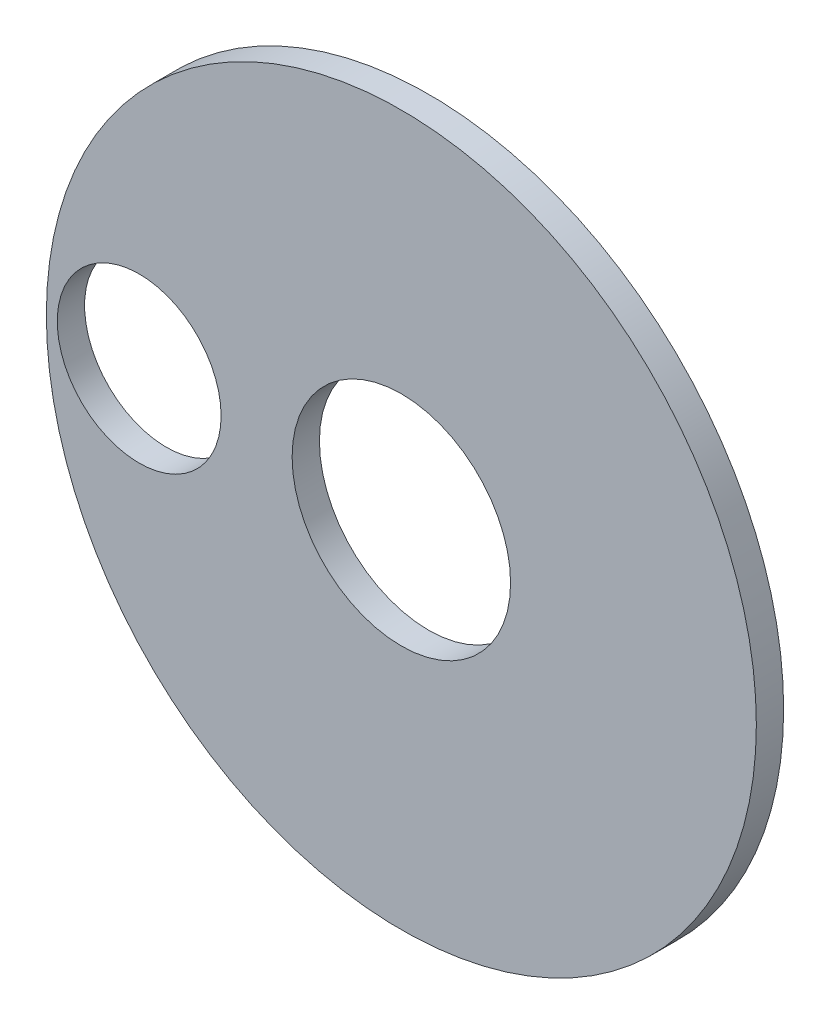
ISO-10303-21;
HEADER;
FILE_DESCRIPTION(('STEP AP214'),'2;1');
FILE_NAME('part.step','',(''),(''),'','','');
FILE_SCHEMA(('AUTOMOTIVE_DESIGN { 1 0 10303 214 1 1 1 1 }'));
ENDSEC;
DATA;
#1=APPLICATION_CONTEXT('core data for automotive mechanical design processes');
#2=APPLICATION_PROTOCOL_DEFINITION('international standard','automotive_design',2000,#1);
#3=PRODUCT_CONTEXT('',#1,'mechanical');
#4=PRODUCT('Part','Part','',(#3));
#5=PRODUCT_RELATED_PRODUCT_CATEGORY('part','',(#4));
#6=PRODUCT_DEFINITION_FORMATION('','',#4);
#7=PRODUCT_DEFINITION_CONTEXT('part definition',#1,'design');
#8=PRODUCT_DEFINITION('design','',#6,#7);
#9=PRODUCT_DEFINITION_SHAPE('','',#8);
#10=(LENGTH_UNIT() NAMED_UNIT(*) SI_UNIT(.MILLI.,.METRE.));
#11=(NAMED_UNIT(*) PLANE_ANGLE_UNIT() SI_UNIT($,.RADIAN.));
#12=(NAMED_UNIT(*) SI_UNIT($,.STERADIAN.) SOLID_ANGLE_UNIT());
#13=UNCERTAINTY_MEASURE_WITH_UNIT(LENGTH_MEASURE(1.E-05),#10,'distance_accuracy_value','');
#14=(GEOMETRIC_REPRESENTATION_CONTEXT(3) GLOBAL_UNCERTAINTY_ASSIGNED_CONTEXT((#13)) GLOBAL_UNIT_ASSIGNED_CONTEXT((#10,
#11,#12)) REPRESENTATION_CONTEXT('',''));
#15=CARTESIAN_POINT('',(0.,0.,0.));
#16=DIRECTION('',(0.,0.,1.));
#17=DIRECTION('',(1.,0.,0.));
#18=AXIS2_PLACEMENT_3D('',#15,#16,#17);
#19=CARTESIAN_POINT('',(0.,0.,1.5875));
#20=DIRECTION('',(0.,0.,1.));
#21=DIRECTION('',(1.,0.,0.));
#22=AXIS2_PLACEMENT_3D('',#19,#20,#21);
#23=PLANE('',#22);
#24=CARTESIAN_POINT('',(0.,0.,1.5875));
#25=DIRECTION('',(0.,0.,1.));
#26=DIRECTION('',(1.,0.,0.));
#27=AXIS2_PLACEMENT_3D('',#24,#25,#26);
#28=CIRCLE('',#27,6.35);
#29=CARTESIAN_POINT('',(6.35,0.,1.5875));
#30=VERTEX_POINT('',#29);
#31=EDGE_CURVE('E40',#30,#30,#28,.T.);
#32=ORIENTED_EDGE('',*,*,#31,.F.);
#33=EDGE_LOOP('',(#32));
#34=FACE_BOUND('',#33,.T.);
#35=CARTESIAN_POINT('',(0.,0.,1.5875));
#36=DIRECTION('',(0.,0.,1.));
#37=DIRECTION('',(1.,0.,0.));
#38=AXIS2_PLACEMENT_3D('',#35,#36,#37);
#39=CIRCLE('',#38,20.6375);
#40=CARTESIAN_POINT('',(20.6375,0.,1.5875));
#41=VERTEX_POINT('',#40);
#42=EDGE_CURVE('E10',#41,#41,#39,.T.);
#43=ORIENTED_EDGE('',*,*,#42,.T.);
#44=EDGE_LOOP('',(#43));
#45=FACE_BOUND('',#44,.T.);
#46=CARTESIAN_POINT('',(-15.24,0.,1.5875));
#47=DIRECTION('',(0.,0.,1.));
#48=DIRECTION('',(1.,0.,0.));
#49=AXIS2_PLACEMENT_3D('',#46,#47,#48);
#50=CIRCLE('',#49,4.7625);
#51=CARTESIAN_POINT('',(-10.4775,0.,1.5875));
#52=VERTEX_POINT('',#51);
#53=EDGE_CURVE('E49',#52,#52,#50,.T.);
#54=ORIENTED_EDGE('',*,*,#53,.F.);
#55=EDGE_LOOP('',(#54));
#56=FACE_BOUND('',#55,.T.);
#57=ADVANCED_FACE('F29',(#34,#45,#56),#23,.T.);
#58=CARTESIAN_POINT('',(0.,0.,0.));
#59=DIRECTION('',(0.,0.,1.));
#60=DIRECTION('',(1.,0.,0.));
#61=AXIS2_PLACEMENT_3D('',#58,#59,#60);
#62=PLANE('',#61);
#63=CARTESIAN_POINT('',(0.,0.,0.));
#64=DIRECTION('',(0.,0.,1.));
#65=DIRECTION('',(1.,0.,0.));
#66=AXIS2_PLACEMENT_3D('',#63,#64,#65);
#67=CIRCLE('',#66,6.35);
#68=CARTESIAN_POINT('',(6.35,0.,0.));
#69=VERTEX_POINT('',#68);
#70=EDGE_CURVE('E44',#69,#69,#67,.T.);
#71=ORIENTED_EDGE('',*,*,#70,.T.);
#72=EDGE_LOOP('',(#71));
#73=FACE_BOUND('',#72,.T.);
#74=CARTESIAN_POINT('',(0.,0.,0.));
#75=DIRECTION('',(0.,0.,1.));
#76=DIRECTION('',(1.,0.,0.));
#77=AXIS2_PLACEMENT_3D('',#74,#75,#76);
#78=CIRCLE('',#77,20.6375);
#79=CARTESIAN_POINT('',(20.6375,0.,0.));
#80=VERTEX_POINT('',#79);
#81=EDGE_CURVE('E36',#80,#80,#78,.T.);
#82=ORIENTED_EDGE('',*,*,#81,.F.);
#83=EDGE_LOOP('',(#82));
#84=FACE_BOUND('',#83,.T.);
#85=CARTESIAN_POINT('',(-15.24,0.,0.));
#86=DIRECTION('',(0.,0.,1.));
#87=DIRECTION('',(1.,0.,0.));
#88=AXIS2_PLACEMENT_3D('',#85,#86,#87);
#89=CIRCLE('',#88,4.7625);
#90=CARTESIAN_POINT('',(-10.4775,0.,0.));
#91=VERTEX_POINT('',#90);
#92=EDGE_CURVE('E52',#91,#91,#89,.T.);
#93=ORIENTED_EDGE('',*,*,#92,.T.);
#94=EDGE_LOOP('',(#93));
#95=FACE_BOUND('',#94,.T.);
#96=ADVANCED_FACE('F56',(#73,#84,#95),#62,.F.);
#97=CARTESIAN_POINT('',(0.,0.,1.5875));
#98=DIRECTION('',(0.,0.,-1.));
#99=DIRECTION('',(-1.,0.,0.));
#100=AXIS2_PLACEMENT_3D('',#97,#98,#99);
#101=CYLINDRICAL_SURFACE('',#100,20.6375);
#102=ORIENTED_EDGE('',*,*,#42,.F.);
#103=EDGE_LOOP('',(#102));
#104=FACE_BOUND('',#103,.T.);
#105=ORIENTED_EDGE('',*,*,#81,.T.);
#106=EDGE_LOOP('',(#105));
#107=FACE_BOUND('',#106,.T.);
#108=ADVANCED_FACE('F31',(#104,#107),#101,.T.);
#109=CARTESIAN_POINT('',(0.,0.,1.5875));
#110=DIRECTION('',(0.,0.,-1.));
#111=DIRECTION('',(-1.,0.,0.));
#112=AXIS2_PLACEMENT_3D('',#109,#110,#111);
#113=CYLINDRICAL_SURFACE('',#112,6.35);
#114=ORIENTED_EDGE('',*,*,#31,.T.);
#115=EDGE_LOOP('',(#114));
#116=FACE_BOUND('',#115,.T.);
#117=ORIENTED_EDGE('',*,*,#70,.F.);
#118=EDGE_LOOP('',(#117));
#119=FACE_BOUND('',#118,.T.);
#120=ADVANCED_FACE('F60',(#116,#119),#113,.F.);
#121=CARTESIAN_POINT('',(-15.24,0.,1.5875));
#122=DIRECTION('',(0.,0.,-1.));
#123=DIRECTION('',(-1.,0.,0.));
#124=AXIS2_PLACEMENT_3D('',#121,#122,#123);
#125=CYLINDRICAL_SURFACE('',#124,4.7625);
#126=ORIENTED_EDGE('',*,*,#53,.T.);
#127=EDGE_LOOP('',(#126));
#128=FACE_BOUND('',#127,.T.);
#129=ORIENTED_EDGE('',*,*,#92,.F.);
#130=EDGE_LOOP('',(#129));
#131=FACE_BOUND('',#130,.T.);
#132=ADVANCED_FACE('F58',(#128,#131),#125,.F.);
#133=CLOSED_SHELL('',(#57,#96,#108,#120,#132));
#134=MANIFOLD_SOLID_BREP('B2',#133);
#135=ADVANCED_BREP_SHAPE_REPRESENTATION('',(#18,#134),#14);
#136=SHAPE_DEFINITION_REPRESENTATION(#9,#135);
ENDSEC;
END-ISO-10303-21;
